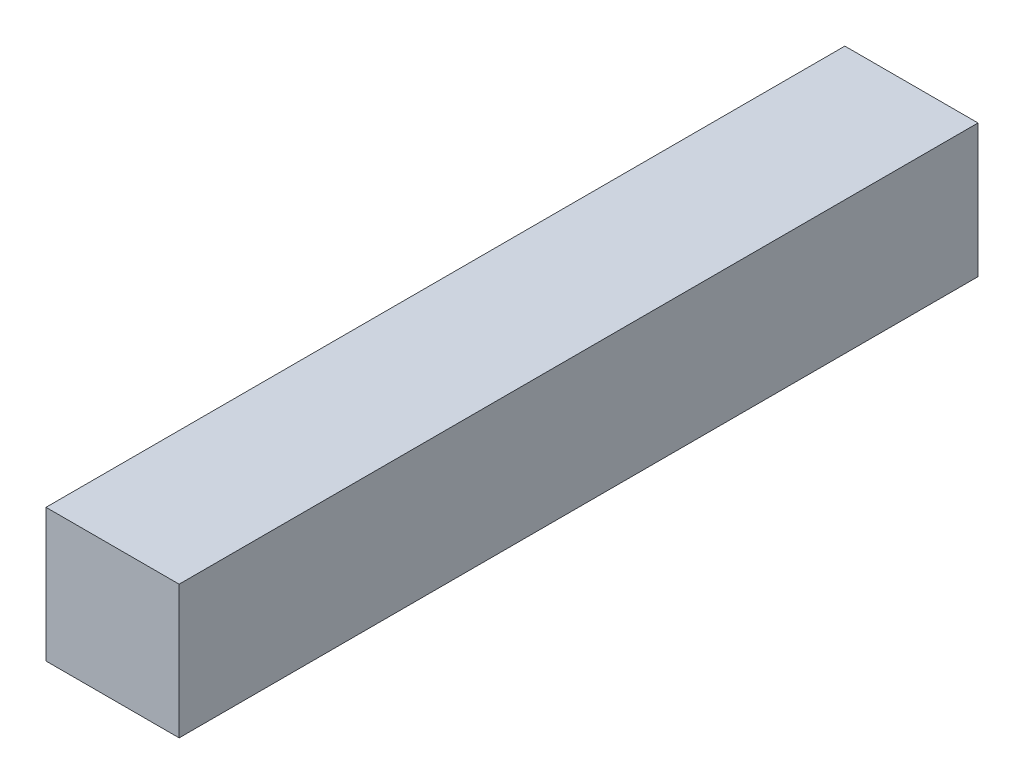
from build123d import *

# Parameters (mm, degrees)
ESQUISSE1_W      = 25
ESQUISSE1_H      = 25
EXTRUSION1_DEPTH = 150


with BuildPart() as part:
    # Esquisse1 → Extrusion1 (new body)
    with BuildSketch(Plane.XY):
        with Locations((12.5, 12.5)):
            Rectangle(ESQUISSE1_W, ESQUISSE1_H)
    extrude(amount=EXTRUSION1_DEPTH)


solid = part.part
